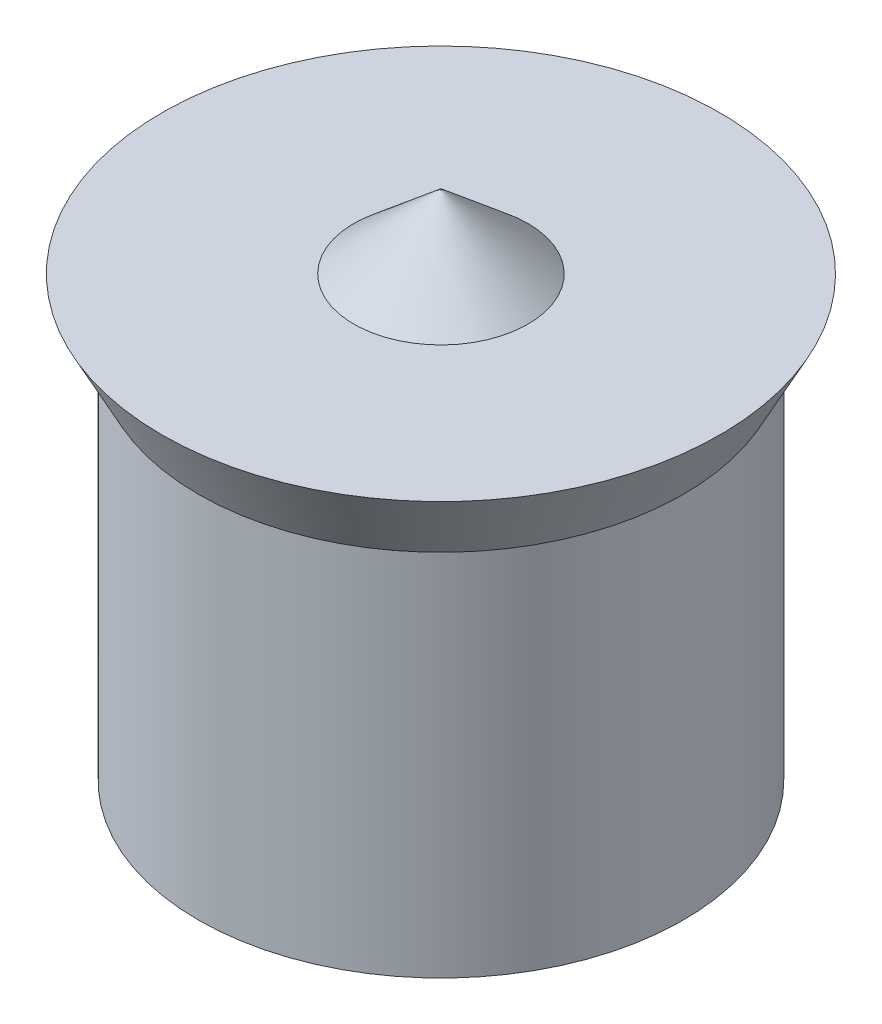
ISO-10303-21;
HEADER;
FILE_DESCRIPTION(('STEP AP214'),'2;1');
FILE_NAME('part.step','',(''),(''),'','','');
FILE_SCHEMA(('AUTOMOTIVE_DESIGN { 1 0 10303 214 1 1 1 1 }'));
ENDSEC;
DATA;
#1=APPLICATION_CONTEXT('core data for automotive mechanical design processes');
#2=APPLICATION_PROTOCOL_DEFINITION('international standard','automotive_design',2000,#1);
#3=PRODUCT_CONTEXT('',#1,'mechanical');
#4=PRODUCT('Part','Part','',(#3));
#5=PRODUCT_RELATED_PRODUCT_CATEGORY('part','',(#4));
#6=PRODUCT_DEFINITION_FORMATION('','',#4);
#7=PRODUCT_DEFINITION_CONTEXT('part definition',#1,'design');
#8=PRODUCT_DEFINITION('design','',#6,#7);
#9=PRODUCT_DEFINITION_SHAPE('','',#8);
#10=(LENGTH_UNIT() NAMED_UNIT(*) SI_UNIT(.MILLI.,.METRE.));
#11=(NAMED_UNIT(*) PLANE_ANGLE_UNIT() SI_UNIT($,.RADIAN.));
#12=(NAMED_UNIT(*) SI_UNIT($,.STERADIAN.) SOLID_ANGLE_UNIT());
#13=UNCERTAINTY_MEASURE_WITH_UNIT(LENGTH_MEASURE(1.E-05),#10,'distance_accuracy_value','');
#14=(GEOMETRIC_REPRESENTATION_CONTEXT(3) GLOBAL_UNCERTAINTY_ASSIGNED_CONTEXT((#13)) GLOBAL_UNIT_ASSIGNED_CONTEXT((#10,
#11,#12)) REPRESENTATION_CONTEXT('',''));
#15=CARTESIAN_POINT('',(0.,0.,0.));
#16=DIRECTION('',(0.,0.,1.));
#17=DIRECTION('',(1.,0.,0.));
#18=AXIS2_PLACEMENT_3D('',#15,#16,#17);
#19=CARTESIAN_POINT('',(0.,66.,0.));
#20=DIRECTION('',(0.,1.,0.));
#21=DIRECTION('',(0.,0.,1.));
#22=AXIS2_PLACEMENT_3D('',#19,#20,#21);
#23=PLANE('',#22);
#24=CARTESIAN_POINT('',(0.,66.,0.));
#25=DIRECTION('',(0.,1.,0.));
#26=DIRECTION('',(0.,0.,1.));
#27=AXIS2_PLACEMENT_3D('',#24,#25,#26);
#28=CIRCLE('',#27,42.);
#29=CARTESIAN_POINT('',(0.,66.,42.));
#30=VERTEX_POINT('',#29);
#31=EDGE_CURVE('E57',#30,#30,#28,.T.);
#32=ORIENTED_EDGE('',*,*,#31,.T.);
#33=EDGE_LOOP('',(#32));
#34=FACE_BOUND('',#33,.T.);
#35=CARTESIAN_POINT('',(0.,66.,0.));
#36=DIRECTION('',(0.,1.,0.));
#37=DIRECTION('',(0.,0.,1.));
#38=AXIS2_PLACEMENT_3D('',#35,#36,#37);
#39=CIRCLE('',#38,13.1200644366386);
#40=CARTESIAN_POINT('',(0.,66.,-13.1200644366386));
#41=VERTEX_POINT('',#40);
#42=EDGE_CURVE('E148',#41,#41,#39,.T.);
#43=ORIENTED_EDGE('',*,*,#42,.F.);
#44=EDGE_LOOP('',(#43));
#45=FACE_BOUND('',#44,.T.);
#46=ADVANCED_FACE('F48',(#34,#45),#23,.T.);
#47=CARTESIAN_POINT('',(0.,55.5,0.));
#48=DIRECTION('',(0.,-1.,0.));
#49=DIRECTION('',(0.,0.,-1.));
#50=AXIS2_PLACEMENT_3D('',#47,#48,#49);
#51=CYLINDRICAL_SURFACE('',#50,36.5);
#52=CARTESIAN_POINT('',(0.,55.5,0.));
#53=DIRECTION('',(0.,1.,0.));
#54=DIRECTION('',(0.,0.,1.));
#55=AXIS2_PLACEMENT_3D('',#52,#53,#54);
#56=CIRCLE('',#55,36.5);
#57=CARTESIAN_POINT('',(0.,55.5,36.5));
#58=VERTEX_POINT('',#57);
#59=EDGE_CURVE('E11',#58,#58,#56,.T.);
#60=ORIENTED_EDGE('',*,*,#59,.F.);
#61=EDGE_LOOP('',(#60));
#62=FACE_BOUND('',#61,.T.);
#63=CARTESIAN_POINT('',(0.,0.,0.));
#64=DIRECTION('',(0.,1.,0.));
#65=DIRECTION('',(0.,0.,1.));
#66=AXIS2_PLACEMENT_3D('',#63,#64,#65);
#67=CIRCLE('',#66,36.5);
#68=CARTESIAN_POINT('',(0.,0.,36.5));
#69=VERTEX_POINT('',#68);
#70=EDGE_CURVE('E99',#69,#69,#67,.T.);
#71=ORIENTED_EDGE('',*,*,#70,.T.);
#72=EDGE_LOOP('',(#71));
#73=FACE_BOUND('',#72,.T.);
#74=ADVANCED_FACE('F49',(#62,#73),#51,.T.);
#75=CARTESIAN_POINT('',(0.,55.5,0.));
#76=DIRECTION('',(0.,1.,0.));
#77=DIRECTION('',(0.,0.,1.));
#78=AXIS2_PLACEMENT_3D('',#75,#76,#77);
#79=CONICAL_SURFACE('',#78,36.5,0.482513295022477);
#80=ORIENTED_EDGE('',*,*,#59,.T.);
#81=EDGE_LOOP('',(#80));
#82=FACE_BOUND('',#81,.T.);
#83=ORIENTED_EDGE('',*,*,#31,.F.);
#84=EDGE_LOOP('',(#83));
#85=FACE_BOUND('',#84,.T.);
#86=ADVANCED_FACE('F81',(#82,#85),#79,.T.);
#87=CARTESIAN_POINT('',(0.,-21.,0.));
#88=DIRECTION('',(0.,-1.,0.));
#89=DIRECTION('',(0.,0.,-1.));
#90=AXIS2_PLACEMENT_3D('',#87,#88,#89);
#91=PLANE('',#90);
#92=CARTESIAN_POINT('',(0.,-21.,0.));
#93=DIRECTION('',(0.,-1.,0.));
#94=DIRECTION('',(0.,0.,-1.));
#95=AXIS2_PLACEMENT_3D('',#92,#93,#94);
#96=CIRCLE('',#95,2.5);
#97=CARTESIAN_POINT('',(0.,-21.,2.5));
#98=VERTEX_POINT('',#97);
#99=EDGE_CURVE('E58',#98,#98,#96,.T.);
#100=ORIENTED_EDGE('',*,*,#99,.T.);
#101=EDGE_LOOP('',(#100));
#102=FACE_BOUND('',#101,.T.);
#103=ADVANCED_FACE('F79',(#102),#91,.T.);
#104=CARTESIAN_POINT('',(0.,-21.,0.));
#105=DIRECTION('',(0.,1.,0.));
#106=DIRECTION('',(0.,0.,1.));
#107=AXIS2_PLACEMENT_3D('',#104,#105,#106);
#108=CONICAL_SURFACE('',#107,2.5,1.0175020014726);
#109=CARTESIAN_POINT('',(0.,0.,36.5));
#110=CARTESIAN_POINT('',(0.,-0.218750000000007,36.1458333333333));
#111=CARTESIAN_POINT('',(0.,-0.437500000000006,35.7916666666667));
#112=CARTESIAN_POINT('',(0.,-0.875000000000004,35.0833333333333));
#113=CARTESIAN_POINT('',(0.,-1.09375,34.7291666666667));
#114=CARTESIAN_POINT('',(0.,-1.53125,34.0208333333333));
#115=CARTESIAN_POINT('',(0.,-1.75,33.6666666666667));
#116=CARTESIAN_POINT('',(0.,-2.1875,32.9583333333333));
#117=CARTESIAN_POINT('',(0.,-2.40625,32.6041666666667));
#118=CARTESIAN_POINT('',(0.,-2.84375,31.8958333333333));
#119=CARTESIAN_POINT('',(0.,-3.0625,31.5416666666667));
#120=CARTESIAN_POINT('',(0.,-3.5,30.8333333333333));
#121=CARTESIAN_POINT('',(0.,-3.71875,30.4791666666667));
#122=CARTESIAN_POINT('',(0.,-4.15625,29.7708333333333));
#123=CARTESIAN_POINT('',(0.,-4.375,29.4166666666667));
#124=CARTESIAN_POINT('',(0.,-4.8125,28.7083333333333));
#125=CARTESIAN_POINT('',(0.,-5.03125,28.3541666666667));
#126=CARTESIAN_POINT('',(0.,-5.46875,27.6458333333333));
#127=CARTESIAN_POINT('',(0.,-5.6875,27.2916666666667));
#128=CARTESIAN_POINT('',(0.,-6.125,26.5833333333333));
#129=CARTESIAN_POINT('',(0.,-6.34375,26.2291666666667));
#130=CARTESIAN_POINT('',(0.,-6.78125,25.5208333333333));
#131=CARTESIAN_POINT('',(0.,-7.,25.1666666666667));
#132=CARTESIAN_POINT('',(0.,-7.4375,24.4583333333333));
#133=CARTESIAN_POINT('',(0.,-7.65625,24.1041666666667));
#134=CARTESIAN_POINT('',(0.,-8.09375,23.3958333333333));
#135=CARTESIAN_POINT('',(0.,-8.3125,23.0416666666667));
#136=CARTESIAN_POINT('',(0.,-8.75,22.3333333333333));
#137=CARTESIAN_POINT('',(0.,-8.96875,21.9791666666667));
#138=CARTESIAN_POINT('',(0.,-9.40625,21.2708333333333));
#139=CARTESIAN_POINT('',(0.,-9.625,20.9166666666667));
#140=CARTESIAN_POINT('',(0.,-10.0625,20.2083333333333));
#141=CARTESIAN_POINT('',(0.,-10.28125,19.8541666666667));
#142=CARTESIAN_POINT('',(0.,-10.71875,19.1458333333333));
#143=CARTESIAN_POINT('',(0.,-10.9375,18.7916666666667));
#144=CARTESIAN_POINT('',(0.,-11.375,18.0833333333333));
#145=CARTESIAN_POINT('',(0.,-11.59375,17.7291666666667));
#146=CARTESIAN_POINT('',(0.,-12.03125,17.0208333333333));
#147=CARTESIAN_POINT('',(0.,-12.25,16.6666666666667));
#148=CARTESIAN_POINT('',(0.,-12.6875,15.9583333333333));
#149=CARTESIAN_POINT('',(0.,-12.90625,15.6041666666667));
#150=CARTESIAN_POINT('',(0.,-13.34375,14.8958333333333));
#151=CARTESIAN_POINT('',(0.,-13.5625,14.5416666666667));
#152=CARTESIAN_POINT('',(0.,-14.,13.8333333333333));
#153=CARTESIAN_POINT('',(0.,-14.21875,13.4791666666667));
#154=CARTESIAN_POINT('',(0.,-14.65625,12.7708333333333));
#155=CARTESIAN_POINT('',(0.,-14.875,12.4166666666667));
#156=CARTESIAN_POINT('',(0.,-15.3125,11.7083333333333));
#157=CARTESIAN_POINT('',(0.,-15.53125,11.3541666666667));
#158=CARTESIAN_POINT('',(0.,-15.96875,10.6458333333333));
#159=CARTESIAN_POINT('',(0.,-16.1875,10.2916666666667));
#160=CARTESIAN_POINT('',(0.,-16.625,9.58333333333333));
#161=CARTESIAN_POINT('',(0.,-16.84375,9.22916666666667));
#162=CARTESIAN_POINT('',(0.,-17.28125,8.52083333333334));
#163=CARTESIAN_POINT('',(0.,-17.5,8.16666666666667));
#164=CARTESIAN_POINT('',(0.,-17.9375,7.45833333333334));
#165=CARTESIAN_POINT('',(0.,-18.15625,7.10416666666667));
#166=CARTESIAN_POINT('',(0.,-18.59375,6.39583333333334));
#167=CARTESIAN_POINT('',(0.,-18.8125,6.04166666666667));
#168=CARTESIAN_POINT('',(0.,-19.25,5.33333333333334));
#169=CARTESIAN_POINT('',(0.,-19.46875,4.97916666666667));
#170=CARTESIAN_POINT('',(0.,-19.90625,4.27083333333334));
#171=CARTESIAN_POINT('',(0.,-20.125,3.91666666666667));
#172=CARTESIAN_POINT('',(0.,-20.5625,3.20833333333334));
#173=CARTESIAN_POINT('',(0.,-20.78125,2.85416666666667));
#174=CARTESIAN_POINT('',(0.,-21.,2.5));
#175=B_SPLINE_CURVE_WITH_KNOTS('',3,(#109,#110,#111,#112,#113,#114,#115,#116,#117,#118,#119,
#120,#121,#122,#123,#124,#125,#126,#127,#128,#129,#130,#131,#132,#133,#134,#135,#136,#137,#138,
#139,#140,#141,#142,#143,#144,#145,#146,#147,#148,#149,#150,#151,#152,#153,#154,#155,#156,#157,
#158,#159,#160,#161,#162,#163,#164,#165,#166,#167,#168,#169,#170,#171,#172,#173,#174),
.UNSPECIFIED.,.F.,.F.,(4,2,2,2,2,2,2,2,2,2,2,2,2,2,2,2,2,2,2,2,2,2,2,2,2,2,2,2,2,2,2,2,4),(0.,
1.248827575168,2.49765515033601,3.74648272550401,4.99531030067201,6.24413787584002,
7.49296545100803,8.74179302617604,9.99062060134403,11.239448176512,12.48827575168,
13.7371033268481,14.9859309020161,16.2347584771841,17.4835860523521,18.7324136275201,
19.9812412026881,21.2300687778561,22.4788963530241,23.7277239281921,24.9765515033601,
26.2253790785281,27.4742066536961,28.7230342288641,29.9718618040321,31.2206893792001,
32.4695169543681,33.7183445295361,34.9671721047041,36.2159996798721,37.4648272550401,
38.7136548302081,39.9624824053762),.UNSPECIFIED.);
#176=EDGE_CURVE('BSEAM118',#69,#98,#175,.T.);
#177=ORIENTED_EDGE('',*,*,#70,.F.);
#178=ORIENTED_EDGE('',*,*,#99,.F.);
#179=ORIENTED_EDGE('',*,*,#176,.T.);
#180=ORIENTED_EDGE('',*,*,#176,.F.);
#181=EDGE_LOOP('',(#177,#179,#178,#180));
#182=FACE_BOUND('',#181,.T.);
#183=ADVANCED_FACE('F118',(#182),#108,.T.);
#184=CARTESIAN_POINT('',(0.,77.,0.));
#185=DIRECTION('',(0.,-1.,0.));
#186=DIRECTION('',(0.,0.,-1.));
#187=AXIS2_PLACEMENT_3D('',#184,#185,#186);
#188=PLANE('',#187);
#189=CARTESIAN_POINT('',(0.,77.,0.));
#190=DIRECTION('',(0.,-1.,0.));
#191=DIRECTION('',(0.,0.,-1.));
#192=AXIS2_PLACEMENT_3D('',#189,#190,#191);
#193=CIRCLE('',#192,0.117250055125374);
#194=CARTESIAN_POINT('',(0.,77.,-0.117250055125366));
#195=VERTEX_POINT('',#194);
#196=EDGE_CURVE('E112',#195,#195,#193,.T.);
#197=ORIENTED_EDGE('',*,*,#196,.F.);
#198=EDGE_LOOP('',(#197));
#199=FACE_BOUND('',#198,.T.);
#200=ADVANCED_FACE('F130',(#199),#188,.F.);
#201=CARTESIAN_POINT('',(0.,77.,0.));
#202=DIRECTION('',(0.,-1.,0.));
#203=DIRECTION('',(0.,0.,-1.));
#204=AXIS2_PLACEMENT_3D('',#201,#202,#203);
#205=CONICAL_SURFACE('',#204,0.117250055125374,0.86864613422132);
#206=CARTESIAN_POINT('',(0.,66.,-13.1200644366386));
#207=CARTESIAN_POINT('',(0.,66.1145833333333,-12.9846184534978));
#208=CARTESIAN_POINT('',(0.,66.2291666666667,-12.8491724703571));
#209=CARTESIAN_POINT('',(0.,66.4583333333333,-12.5782805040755));
#210=CARTESIAN_POINT('',(0.,66.5729166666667,-12.4428345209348));
#211=CARTESIAN_POINT('',(0.,66.8020833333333,-12.1719425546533));
#212=CARTESIAN_POINT('',(0.,66.9166666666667,-12.0364965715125));
#213=CARTESIAN_POINT('',(0.,67.1458333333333,-11.765604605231));
#214=CARTESIAN_POINT('',(0.,67.2604166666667,-11.6301586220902));
#215=CARTESIAN_POINT('',(0.,67.4895833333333,-11.3592666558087));
#216=CARTESIAN_POINT('',(0.,67.6041666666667,-11.2238206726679));
#217=CARTESIAN_POINT('',(0.,67.8333333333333,-10.9529287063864));
#218=CARTESIAN_POINT('',(0.,67.9479166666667,-10.8174827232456));
#219=CARTESIAN_POINT('',(0.,68.1770833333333,-10.5465907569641));
#220=CARTESIAN_POINT('',(0.,68.2916666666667,-10.4111447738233));
#221=CARTESIAN_POINT('',(0.,68.5208333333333,-10.1402528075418));
#222=CARTESIAN_POINT('',(0.,68.6354166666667,-10.0048068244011));
#223=CARTESIAN_POINT('',(0.,68.8645833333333,-9.73391485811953));
#224=CARTESIAN_POINT('',(0.,68.9791666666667,-9.59846887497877));
#225=CARTESIAN_POINT('',(0.,69.2083333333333,-9.32757690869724));
#226=CARTESIAN_POINT('',(0.,69.3229166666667,-9.19213092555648));
#227=CARTESIAN_POINT('',(0.,69.5520833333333,-8.92123895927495));
#228=CARTESIAN_POINT('',(0.,69.6666666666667,-8.78579297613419));
#229=CARTESIAN_POINT('',(0.,69.8958333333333,-8.51490100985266));
#230=CARTESIAN_POINT('',(0.,70.0104166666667,-8.3794550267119));
#231=CARTESIAN_POINT('',(0.,70.2395833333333,-8.10856306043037));
#232=CARTESIAN_POINT('',(0.,70.3541666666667,-7.97311707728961));
#233=CARTESIAN_POINT('',(0.,70.5833333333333,-7.70222511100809));
#234=CARTESIAN_POINT('',(0.,70.6979166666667,-7.56677912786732));
#235=CARTESIAN_POINT('',(0.,70.9270833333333,-7.2958871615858));
#236=CARTESIAN_POINT('',(0.,71.0416666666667,-7.16044117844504));
#237=CARTESIAN_POINT('',(0.,71.2708333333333,-6.88954921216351));
#238=CARTESIAN_POINT('',(0.,71.3854166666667,-6.75410322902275));
#239=CARTESIAN_POINT('',(0.,71.6145833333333,-6.48321126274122));
#240=CARTESIAN_POINT('',(0.,71.7291666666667,-6.34776527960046));
#241=CARTESIAN_POINT('',(0.,71.9583333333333,-6.07687331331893));
#242=CARTESIAN_POINT('',(0.,72.0729166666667,-5.94142733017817));
#243=CARTESIAN_POINT('',(0.,72.3020833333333,-5.67053536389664));
#244=CARTESIAN_POINT('',(0.,72.4166666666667,-5.53508938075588));
#245=CARTESIAN_POINT('',(0.,72.6458333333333,-5.26419741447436));
#246=CARTESIAN_POINT('',(0.,72.7604166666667,-5.12875143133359));
#247=CARTESIAN_POINT('',(0.,72.9895833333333,-4.85785946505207));
#248=CARTESIAN_POINT('',(0.,73.1041666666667,-4.7224134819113));
#249=CARTESIAN_POINT('',(0.,73.3333333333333,-4.45152151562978));
#250=CARTESIAN_POINT('',(0.,73.4479166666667,-4.31607553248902));
#251=CARTESIAN_POINT('',(0.,73.6770833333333,-4.04518356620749));
#252=CARTESIAN_POINT('',(0.,73.7916666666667,-3.90973758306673));
#253=CARTESIAN_POINT('',(0.,74.0208333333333,-3.6388456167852));
#254=CARTESIAN_POINT('',(0.,74.1354166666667,-3.50339963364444));
#255=CARTESIAN_POINT('',(0.,74.3645833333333,-3.23250766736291));
#256=CARTESIAN_POINT('',(0.,74.4791666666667,-3.09706168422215));
#257=CARTESIAN_POINT('',(0.,74.7083333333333,-2.82616971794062));
#258=CARTESIAN_POINT('',(0.,74.8229166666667,-2.69072373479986));
#259=CARTESIAN_POINT('',(0.,75.0520833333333,-2.41983176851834));
#260=CARTESIAN_POINT('',(0.,75.1666666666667,-2.28438578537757));
#261=CARTESIAN_POINT('',(0.,75.3958333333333,-2.01349381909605));
#262=CARTESIAN_POINT('',(0.,75.5104166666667,-1.87804783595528));
#263=CARTESIAN_POINT('',(0.,75.7395833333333,-1.60715586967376));
#264=CARTESIAN_POINT('',(0.,75.8541666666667,-1.47170988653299));
#265=CARTESIAN_POINT('',(0.,76.0833333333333,-1.20081792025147));
#266=CARTESIAN_POINT('',(0.,76.1979166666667,-1.06537193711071));
#267=CARTESIAN_POINT('',(0.,76.4270833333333,-0.79447997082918));
#268=CARTESIAN_POINT('',(0.,76.5416666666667,-0.659033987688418));
#269=CARTESIAN_POINT('',(0.,76.7708333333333,-0.388142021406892));
#270=CARTESIAN_POINT('',(0.,76.8854166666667,-0.252696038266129));
#271=CARTESIAN_POINT('',(0.,77.,-0.117250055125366));
#272=B_SPLINE_CURVE_WITH_KNOTS('',3,(#206,#207,#208,#209,#210,#211,#212,#213,#214,#215,#216,
#217,#218,#219,#220,#221,#222,#223,#224,#225,#226,#227,#228,#229,#230,#231,#232,#233,#234,#235,
#236,#237,#238,#239,#240,#241,#242,#243,#244,#245,#246,#247,#248,#249,#250,#251,#252,#253,#254,
#255,#256,#257,#258,#259,#260,#261,#262,#263,#264,#265,#266,#267,#268,#269,#270,#271),
.UNSPECIFIED.,.F.,.F.,(4,2,2,2,2,2,2,2,2,2,2,2,2,2,2,2,2,2,2,2,2,2,2,2,2,2,2,2,2,2,2,2,4),(0.,
0.532235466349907,1.06447093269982,1.59670639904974,2.12894186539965,2.66117733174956,
3.19341279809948,3.7256482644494,4.25788373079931,4.79011919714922,5.32235466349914,
5.85459012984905,6.38682559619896,6.91906106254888,7.4512965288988,7.98353199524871,
8.51576746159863,9.04800292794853,9.58023839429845,10.1124738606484,10.6447093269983,
11.1769447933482,11.7091802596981,12.241415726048,12.7736511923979,13.3058866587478,
13.8381221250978,14.3703575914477,14.9025930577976,15.4348285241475,15.9670639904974,
16.4992994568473,17.0315349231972),.UNSPECIFIED.);
#273=EDGE_CURVE('BSEAM131',#41,#195,#272,.T.);
#274=ORIENTED_EDGE('',*,*,#42,.T.);
#275=ORIENTED_EDGE('',*,*,#196,.T.);
#276=ORIENTED_EDGE('',*,*,#273,.T.);
#277=ORIENTED_EDGE('',*,*,#273,.F.);
#278=EDGE_LOOP('',(#274,#276,#275,#277));
#279=FACE_BOUND('',#278,.T.);
#280=ADVANCED_FACE('F131',(#279),#205,.T.);
#281=CLOSED_SHELL('',(#46,#74,#86,#103,#183,#200,#280));
#282=MANIFOLD_SOLID_BREP('B2',#281);
#283=ADVANCED_BREP_SHAPE_REPRESENTATION('',(#18,#282),#14);
#284=SHAPE_DEFINITION_REPRESENTATION(#9,#283);
ENDSEC;
END-ISO-10303-21;
